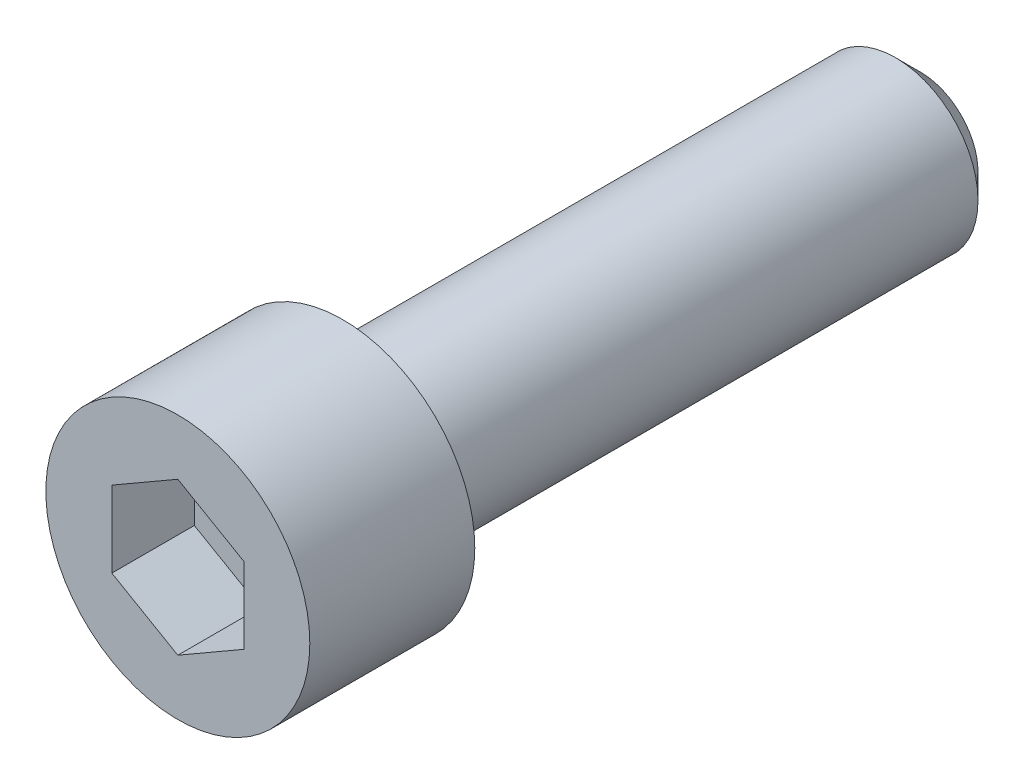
ISO-10303-21;
HEADER;
FILE_DESCRIPTION(('STEP AP214'),'2;1');
FILE_NAME('part.step','',(''),(''),'','','');
FILE_SCHEMA(('AUTOMOTIVE_DESIGN { 1 0 10303 214 1 1 1 1 }'));
ENDSEC;
DATA;
#1=APPLICATION_CONTEXT('core data for automotive mechanical design processes');
#2=APPLICATION_PROTOCOL_DEFINITION('international standard','automotive_design',2000,#1);
#3=PRODUCT_CONTEXT('',#1,'mechanical');
#4=PRODUCT('Part','Part','',(#3));
#5=PRODUCT_RELATED_PRODUCT_CATEGORY('part','',(#4));
#6=PRODUCT_DEFINITION_FORMATION('','',#4);
#7=PRODUCT_DEFINITION_CONTEXT('part definition',#1,'design');
#8=PRODUCT_DEFINITION('design','',#6,#7);
#9=PRODUCT_DEFINITION_SHAPE('','',#8);
#10=(LENGTH_UNIT() NAMED_UNIT(*) SI_UNIT(.MILLI.,.METRE.));
#11=(NAMED_UNIT(*) PLANE_ANGLE_UNIT() SI_UNIT($,.RADIAN.));
#12=(NAMED_UNIT(*) SI_UNIT($,.STERADIAN.) SOLID_ANGLE_UNIT());
#13=UNCERTAINTY_MEASURE_WITH_UNIT(LENGTH_MEASURE(1.E-05),#10,'distance_accuracy_value','');
#14=(GEOMETRIC_REPRESENTATION_CONTEXT(3) GLOBAL_UNCERTAINTY_ASSIGNED_CONTEXT((#13)) GLOBAL_UNIT_ASSIGNED_CONTEXT((#10,
#11,#12)) REPRESENTATION_CONTEXT('',''));
#15=CARTESIAN_POINT('',(0.,0.,0.));
#16=DIRECTION('',(0.,0.,1.));
#17=DIRECTION('',(1.,0.,0.));
#18=AXIS2_PLACEMENT_3D('',#15,#16,#17);
#19=CARTESIAN_POINT('',(0.,4.618802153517,5.));
#20=DIRECTION('',(-0.5,-0.86602540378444,0.));
#21=DIRECTION('',(0.86602540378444,-0.5,0.));
#22=AXIS2_PLACEMENT_3D('',#19,#20,#21);
#23=PLANE('',#22);
#24=DIRECTION('',(0.,0.,1.));
#25=VECTOR('',#24,1.);
#26=CARTESIAN_POINT('',(4.,2.30940107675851,5.));
#27=LINE('',#26,#25);
#28=CARTESIAN_POINT('',(4.,2.30940107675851,5.));
#29=VERTEX_POINT('',#28);
#30=CARTESIAN_POINT('',(4.,2.30940107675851,10.));
#31=VERTEX_POINT('',#30);
#32=EDGE_CURVE('E63',#29,#31,#27,.T.);
#33=ORIENTED_EDGE('',*,*,#32,.T.);
#34=DIRECTION('',(0.86602540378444,-0.5,0.));
#35=VECTOR('',#34,1.);
#36=CARTESIAN_POINT('',(0.,4.618802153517,10.));
#37=LINE('',#36,#35);
#38=CARTESIAN_POINT('',(0.,4.618802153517,10.));
#39=VERTEX_POINT('',#38);
#40=EDGE_CURVE('E29',#39,#31,#37,.T.);
#41=ORIENTED_EDGE('',*,*,#40,.F.);
#42=DIRECTION('',(0.,0.,1.));
#43=VECTOR('',#42,1.);
#44=CARTESIAN_POINT('',(0.,4.618802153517,5.));
#45=LINE('',#44,#43);
#46=CARTESIAN_POINT('',(0.,4.618802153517,5.));
#47=VERTEX_POINT('',#46);
#48=EDGE_CURVE('E33',#47,#39,#45,.T.);
#49=ORIENTED_EDGE('',*,*,#48,.F.);
#50=DIRECTION('',(0.86602540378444,-0.5,0.));
#51=VECTOR('',#50,1.);
#52=CARTESIAN_POINT('',(0.,4.618802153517,5.));
#53=LINE('',#52,#51);
#54=EDGE_CURVE('E65',#47,#29,#53,.T.);
#55=ORIENTED_EDGE('',*,*,#54,.T.);
#56=EDGE_LOOP('',(#33,#41,#49,#55));
#57=FACE_BOUND('',#56,.T.);
#58=ADVANCED_FACE('F14',(#57),#23,.T.);
#59=CARTESIAN_POINT('',(4.,-2.30940107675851,5.));
#60=DIRECTION('',(1.,0.,0.));
#61=DIRECTION('',(0.,1.,0.));
#62=AXIS2_PLACEMENT_3D('',#59,#60,#61);
#63=PLANE('',#62);
#64=DIRECTION('',(0.,0.,1.));
#65=VECTOR('',#64,1.);
#66=CARTESIAN_POINT('',(4.,-2.30940107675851,5.));
#67=LINE('',#66,#65);
#68=CARTESIAN_POINT('',(4.,-2.30940107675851,5.));
#69=VERTEX_POINT('',#68);
#70=CARTESIAN_POINT('',(4.,-2.30940107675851,10.));
#71=VERTEX_POINT('',#70);
#72=EDGE_CURVE('E70',#69,#71,#67,.T.);
#73=ORIENTED_EDGE('',*,*,#72,.T.);
#74=DIRECTION('',(0.,1.,0.));
#75=VECTOR('',#74,1.);
#76=CARTESIAN_POINT('',(4.,-2.30940107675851,10.));
#77=LINE('',#76,#75);
#78=EDGE_CURVE('E73',#71,#31,#77,.T.);
#79=ORIENTED_EDGE('',*,*,#78,.T.);
#80=ORIENTED_EDGE('',*,*,#32,.F.);
#81=DIRECTION('',(0.,1.,0.));
#82=VECTOR('',#81,1.);
#83=CARTESIAN_POINT('',(4.,-2.30940107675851,5.));
#84=LINE('',#83,#82);
#85=EDGE_CURVE('E100',#69,#29,#84,.T.);
#86=ORIENTED_EDGE('',*,*,#85,.F.);
#87=EDGE_LOOP('',(#73,#79,#80,#86));
#88=FACE_BOUND('',#87,.T.);
#89=ADVANCED_FACE('F74',(#88),#63,.F.);
#90=CARTESIAN_POINT('',(0.,-4.618802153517,5.));
#91=DIRECTION('',(0.5,-0.86602540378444,0.));
#92=DIRECTION('',(0.86602540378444,0.5,0.));
#93=AXIS2_PLACEMENT_3D('',#90,#91,#92);
#94=PLANE('',#93);
#95=DIRECTION('',(0.,0.,1.));
#96=VECTOR('',#95,1.);
#97=CARTESIAN_POINT('',(0.,-4.618802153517,5.));
#98=LINE('',#97,#96);
#99=CARTESIAN_POINT('',(0.,-4.618802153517,5.));
#100=VERTEX_POINT('',#99);
#101=CARTESIAN_POINT('',(0.,-4.618802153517,10.));
#102=VERTEX_POINT('',#101);
#103=EDGE_CURVE('E108',#100,#102,#98,.T.);
#104=ORIENTED_EDGE('',*,*,#103,.T.);
#105=DIRECTION('',(0.86602540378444,0.5,0.));
#106=VECTOR('',#105,1.);
#107=CARTESIAN_POINT('',(0.,-4.618802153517,10.));
#108=LINE('',#107,#106);
#109=EDGE_CURVE('E78',#102,#71,#108,.T.);
#110=ORIENTED_EDGE('',*,*,#109,.T.);
#111=ORIENTED_EDGE('',*,*,#72,.F.);
#112=DIRECTION('',(0.86602540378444,0.5,0.));
#113=VECTOR('',#112,1.);
#114=CARTESIAN_POINT('',(0.,-4.618802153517,5.));
#115=LINE('',#114,#113);
#116=EDGE_CURVE('E97',#100,#69,#115,.T.);
#117=ORIENTED_EDGE('',*,*,#116,.F.);
#118=EDGE_LOOP('',(#104,#110,#111,#117));
#119=FACE_BOUND('',#118,.T.);
#120=ADVANCED_FACE('F141',(#119),#94,.F.);
#121=CARTESIAN_POINT('',(0.,-4.618802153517,5.));
#122=DIRECTION('',(0.5,0.86602540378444,0.));
#123=DIRECTION('',(-0.86602540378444,0.5,0.));
#124=AXIS2_PLACEMENT_3D('',#121,#122,#123);
#125=PLANE('',#124);
#126=DIRECTION('',(0.,0.,1.));
#127=VECTOR('',#126,1.);
#128=CARTESIAN_POINT('',(-4.,-2.30940107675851,5.));
#129=LINE('',#128,#127);
#130=CARTESIAN_POINT('',(-4.,-2.30940107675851,5.));
#131=VERTEX_POINT('',#130);
#132=CARTESIAN_POINT('',(-4.,-2.30940107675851,10.));
#133=VERTEX_POINT('',#132);
#134=EDGE_CURVE('E106',#131,#133,#129,.T.);
#135=ORIENTED_EDGE('',*,*,#134,.T.);
#136=DIRECTION('',(-0.86602540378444,0.5,0.));
#137=VECTOR('',#136,1.);
#138=CARTESIAN_POINT('',(0.,-4.618802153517,10.));
#139=LINE('',#138,#137);
#140=EDGE_CURVE('E189',#102,#133,#139,.T.);
#141=ORIENTED_EDGE('',*,*,#140,.F.);
#142=ORIENTED_EDGE('',*,*,#103,.F.);
#143=DIRECTION('',(-0.86602540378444,0.5,0.));
#144=VECTOR('',#143,1.);
#145=CARTESIAN_POINT('',(0.,-4.618802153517,5.));
#146=LINE('',#145,#144);
#147=EDGE_CURVE('E94',#100,#131,#146,.T.);
#148=ORIENTED_EDGE('',*,*,#147,.T.);
#149=EDGE_LOOP('',(#135,#141,#142,#148));
#150=FACE_BOUND('',#149,.T.);
#151=ADVANCED_FACE('F153',(#150),#125,.T.);
#152=CARTESIAN_POINT('',(-4.,2.30940107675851,5.));
#153=DIRECTION('',(-1.,0.,0.));
#154=DIRECTION('',(0.,0.,1.));
#155=AXIS2_PLACEMENT_3D('',#152,#153,#154);
#156=PLANE('',#155);
#157=DIRECTION('',(0.,0.,1.));
#158=VECTOR('',#157,1.);
#159=CARTESIAN_POINT('',(-4.,2.30940107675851,5.));
#160=LINE('',#159,#158);
#161=CARTESIAN_POINT('',(-4.,2.30940107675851,5.));
#162=VERTEX_POINT('',#161);
#163=CARTESIAN_POINT('',(-4.,2.30940107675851,10.));
#164=VERTEX_POINT('',#163);
#165=EDGE_CURVE('E104',#162,#164,#160,.T.);
#166=ORIENTED_EDGE('',*,*,#165,.T.);
#167=DIRECTION('',(0.,-1.,0.));
#168=VECTOR('',#167,1.);
#169=CARTESIAN_POINT('',(-4.,2.30940107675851,10.));
#170=LINE('',#169,#168);
#171=EDGE_CURVE('E190',#164,#133,#170,.T.);
#172=ORIENTED_EDGE('',*,*,#171,.T.);
#173=ORIENTED_EDGE('',*,*,#134,.F.);
#174=DIRECTION('',(0.,-1.,0.));
#175=VECTOR('',#174,1.);
#176=CARTESIAN_POINT('',(-4.,2.30940107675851,5.));
#177=LINE('',#176,#175);
#178=EDGE_CURVE('E91',#162,#131,#177,.T.);
#179=ORIENTED_EDGE('',*,*,#178,.F.);
#180=EDGE_LOOP('',(#166,#172,#173,#179));
#181=FACE_BOUND('',#180,.T.);
#182=ADVANCED_FACE('F149',(#181),#156,.F.);
#183=CARTESIAN_POINT('',(0.,4.618802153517,5.));
#184=DIRECTION('',(-0.5,0.86602540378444,0.));
#185=DIRECTION('',(-0.86602540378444,-0.5,0.));
#186=AXIS2_PLACEMENT_3D('',#183,#184,#185);
#187=PLANE('',#186);
#188=DIRECTION('',(-0.86602540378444,-0.5,0.));
#189=VECTOR('',#188,1.);
#190=CARTESIAN_POINT('',(0.,4.618802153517,5.));
#191=LINE('',#190,#189);
#192=EDGE_CURVE('E88',#47,#162,#191,.T.);
#193=ORIENTED_EDGE('',*,*,#192,.F.);
#194=ORIENTED_EDGE('',*,*,#48,.T.);
#195=DIRECTION('',(-0.86602540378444,-0.5,0.));
#196=VECTOR('',#195,1.);
#197=CARTESIAN_POINT('',(0.,4.618802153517,10.));
#198=LINE('',#197,#196);
#199=EDGE_CURVE('E84',#39,#164,#198,.T.);
#200=ORIENTED_EDGE('',*,*,#199,.T.);
#201=ORIENTED_EDGE('',*,*,#165,.F.);
#202=EDGE_LOOP('',(#193,#194,#200,#201));
#203=FACE_BOUND('',#202,.T.);
#204=ADVANCED_FACE('F146',(#203),#187,.F.);
#205=CARTESIAN_POINT('',(-4.,6.92820323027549,5.));
#206=DIRECTION('',(0.,0.,-1.));
#207=DIRECTION('',(-1.,0.,0.));
#208=AXIS2_PLACEMENT_3D('',#205,#206,#207);
#209=PLANE('',#208);
#210=ORIENTED_EDGE('',*,*,#54,.F.);
#211=ORIENTED_EDGE('',*,*,#192,.T.);
#212=ORIENTED_EDGE('',*,*,#178,.T.);
#213=ORIENTED_EDGE('',*,*,#147,.F.);
#214=ORIENTED_EDGE('',*,*,#116,.T.);
#215=ORIENTED_EDGE('',*,*,#85,.T.);
#216=EDGE_LOOP('',(#210,#211,#212,#213,#214,#215));
#217=FACE_BOUND('',#216,.T.);
#218=ADVANCED_FACE('F145',(#217),#209,.F.);
#219=CARTESIAN_POINT('',(0.,0.,10.));
#220=DIRECTION('',(0.,0.,1.));
#221=DIRECTION('',(1.,0.,0.));
#222=AXIS2_PLACEMENT_3D('',#219,#220,#221);
#223=PLANE('',#222);
#224=CARTESIAN_POINT('',(0.,0.,10.));
#225=DIRECTION('',(0.,0.,1.));
#226=DIRECTION('',(1.,0.,0.));
#227=AXIS2_PLACEMENT_3D('',#224,#225,#226);
#228=CIRCLE('',#227,8.);
#229=CARTESIAN_POINT('',(8.,0.,10.));
#230=VERTEX_POINT('',#229);
#231=EDGE_CURVE('E116',#230,#230,#228,.T.);
#232=ORIENTED_EDGE('',*,*,#231,.T.);
#233=EDGE_LOOP('',(#232));
#234=FACE_BOUND('',#233,.T.);
#235=ORIENTED_EDGE('',*,*,#199,.F.);
#236=ORIENTED_EDGE('',*,*,#40,.T.);
#237=ORIENTED_EDGE('',*,*,#78,.F.);
#238=ORIENTED_EDGE('',*,*,#109,.F.);
#239=ORIENTED_EDGE('',*,*,#140,.T.);
#240=ORIENTED_EDGE('',*,*,#171,.F.);
#241=EDGE_LOOP('',(#235,#236,#237,#238,#239,#240));
#242=FACE_BOUND('',#241,.T.);
#243=ADVANCED_FACE('F81',(#234,#242),#223,.T.);
#244=CARTESIAN_POINT('',(0.,0.,-15.));
#245=DIRECTION('',(0.,0.,1.));
#246=DIRECTION('',(1.,0.,0.));
#247=AXIS2_PLACEMENT_3D('',#244,#245,#246);
#248=CYLINDRICAL_SURFACE('',#247,8.);
#249=CARTESIAN_POINT('',(0.,0.,0.));
#250=DIRECTION('',(0.,0.,1.));
#251=DIRECTION('',(1.,0.,0.));
#252=AXIS2_PLACEMENT_3D('',#249,#250,#251);
#253=CIRCLE('',#252,8.);
#254=CARTESIAN_POINT('',(8.,0.,0.));
#255=VERTEX_POINT('',#254);
#256=EDGE_CURVE('E113',#255,#255,#253,.T.);
#257=ORIENTED_EDGE('',*,*,#256,.T.);
#258=EDGE_LOOP('',(#257));
#259=FACE_BOUND('',#258,.T.);
#260=ORIENTED_EDGE('',*,*,#231,.F.);
#261=EDGE_LOOP('',(#260));
#262=FACE_BOUND('',#261,.T.);
#263=ADVANCED_FACE('F166',(#259,#262),#248,.T.);
#264=CARTESIAN_POINT('',(8.,0.,0.));
#265=DIRECTION('',(0.,0.,-1.));
#266=DIRECTION('',(-1.,0.,0.));
#267=AXIS2_PLACEMENT_3D('',#264,#265,#266);
#268=PLANE('',#267);
#269=CARTESIAN_POINT('',(0.,0.,0.));
#270=DIRECTION('',(0.,0.,1.));
#271=DIRECTION('',(1.,0.,0.));
#272=AXIS2_PLACEMENT_3D('',#269,#270,#271);
#273=CIRCLE('',#272,5.);
#274=CARTESIAN_POINT('',(5.,0.,0.));
#275=VERTEX_POINT('',#274);
#276=EDGE_CURVE('E69',#275,#275,#273,.T.);
#277=ORIENTED_EDGE('',*,*,#276,.T.);
#278=EDGE_LOOP('',(#277));
#279=FACE_BOUND('',#278,.T.);
#280=ORIENTED_EDGE('',*,*,#256,.F.);
#281=EDGE_LOOP('',(#280));
#282=FACE_BOUND('',#281,.T.);
#283=ADVANCED_FACE('F163',(#279,#282),#268,.T.);
#284=CARTESIAN_POINT('',(0.,0.,-15.));
#285=DIRECTION('',(0.,0.,1.));
#286=DIRECTION('',(1.,0.,0.));
#287=AXIS2_PLACEMENT_3D('',#284,#285,#286);
#288=CYLINDRICAL_SURFACE('',#287,5.);
#289=CARTESIAN_POINT('',(0.,0.,-33.5));
#290=DIRECTION('',(0.,0.,-1.));
#291=DIRECTION('',(-1.,0.,0.));
#292=AXIS2_PLACEMENT_3D('',#289,#290,#291);
#293=CIRCLE('',#292,5.);
#294=CARTESIAN_POINT('',(-5.,0.,-33.5));
#295=VERTEX_POINT('',#294);
#296=EDGE_CURVE('E22',#295,#295,#293,.F.);
#297=ORIENTED_EDGE('',*,*,#296,.T.);
#298=EDGE_LOOP('',(#297));
#299=FACE_BOUND('',#298,.T.);
#300=ORIENTED_EDGE('',*,*,#276,.F.);
#301=EDGE_LOOP('',(#300));
#302=FACE_BOUND('',#301,.T.);
#303=ADVANCED_FACE('F121',(#299,#302),#288,.T.);
#304=CARTESIAN_POINT('',(5.,0.,-35.));
#305=DIRECTION('',(0.,0.,-1.));
#306=DIRECTION('',(-1.,0.,0.));
#307=AXIS2_PLACEMENT_3D('',#304,#305,#306);
#308=PLANE('',#307);
#309=CARTESIAN_POINT('',(0.,0.,-35.));
#310=DIRECTION('',(0.,0.,-1.));
#311=DIRECTION('',(-1.,0.,0.));
#312=AXIS2_PLACEMENT_3D('',#309,#310,#311);
#313=CIRCLE('',#312,3.5);
#314=CARTESIAN_POINT('',(-3.5,0.,-35.));
#315=VERTEX_POINT('',#314);
#316=EDGE_CURVE('E9',#315,#315,#313,.T.);
#317=ORIENTED_EDGE('',*,*,#316,.T.);
#318=EDGE_LOOP('',(#317));
#319=FACE_BOUND('',#318,.T.);
#320=ADVANCED_FACE('F125',(#319),#308,.T.);
#321=CARTESIAN_POINT('',(0.,0.,-33.5));
#322=DIRECTION('',(0.,0.,1.));
#323=DIRECTION('',(1.,0.,0.));
#324=AXIS2_PLACEMENT_3D('',#321,#322,#323);
#325=CONICAL_SURFACE('',#324,5.,0.785398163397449);
#326=ORIENTED_EDGE('',*,*,#316,.F.);
#327=EDGE_LOOP('',(#326));
#328=FACE_BOUND('',#327,.T.);
#329=ORIENTED_EDGE('',*,*,#296,.F.);
#330=EDGE_LOOP('',(#329));
#331=FACE_BOUND('',#330,.T.);
#332=ADVANCED_FACE('F16',(#328,#331),#325,.T.);
#333=CLOSED_SHELL('',(#58,#89,#120,#151,#182,#204,#218,#243,#263,#283,#303,#320,#332));
#334=MANIFOLD_SOLID_BREP('B1',#333);
#335=ADVANCED_BREP_SHAPE_REPRESENTATION('',(#18,#334),#14);
#336=SHAPE_DEFINITION_REPRESENTATION(#9,#335);
ENDSEC;
END-ISO-10303-21;
